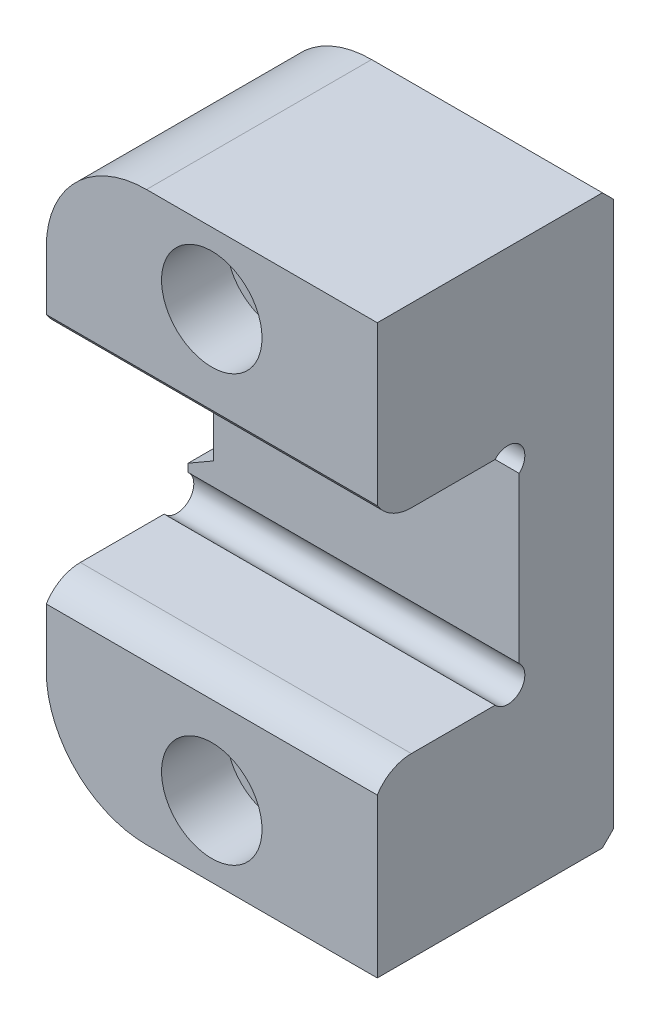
from build123d import *

# Parameters (mm, degrees)
EXTRUDE1_DEPTH              = 22.225
FILLET1_R                   = 13.462
CUT_EXTRUDE1_DEPTH          = 59.887477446
CUT_EXTRUDE2_DEPTH          = 67.599361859
SKETCH6_R                   = 2.286
CUT_EXTRUDE3_DEPTH          = 67.599361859
F_5_16_18_CBORE_D           = 8.72998
F_5_16_18_CBORE_CBORE_D     = 13.49502
F_5_16_18_CBORE_CBORE_DEPTH = 8.73125
CHAMFER3_SIZE               = 3.81
CHAMFER3_SIZE2              = 1.020886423
CHAMFER1_SIZE               = 1.524


with BuildPart() as part:
    # Sketch1 → Extrude1 (new, symmetric)
    with BuildSketch(Plane(origin=(0, 0, 0), x_dir=(0, 0, -1), z_dir=(1, 0, 0))):
        Polygon((0, 14.2875), (19.05, 14.2875), (19.05, -14.2875), (0, -14.2875), (0, -38.1), (31.75, -38.1), (31.75, 38.1), (0, 38.1), align=None)
    extrude(amount=EXTRUDE1_DEPTH, both=True)

    # Fillet1
    fillet1_edges = [part.edges().sort_by_distance(p)[0] for p in [
        (-22.225, 38.1, -15.875),
        (-22.225, -38.1, -15.875),
    ]]
    fillet(fillet1_edges, radius=FILLET1_R)

    # Sketch2 → Cut-Extrude1 (cut, through all)
    with BuildSketch(Plane(origin=(-9.525, 0, -31.75), x_dir=(1, 0, 0), z_dir=(0, 0, 1))):
        Polygon((-13.49375, 10.441543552), (-13.49375, -10.441543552), (-10.31875, -8.608456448), (-10.31875, 8.608456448), align=None)
    extrude(amount=CUT_EXTRUDE1_DEPTH, mode=Mode.SUBTRACT)

    # Sketch5 → Cut-Extrude2 (cut, through all)
    with BuildSketch(Plane(origin=(22.225, 0, 0), x_dir=(0, 0, -1), z_dir=(1, 0, 0))):
        with BuildLine():
            Line((-1.778, -13.6525), (4.572, -13.6525))
            Line((4.572, -13.6525), (4.572, -14.2875))
            ThreePointArc((4.572, -14.2875), (1.956909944, -14.9651379), (0, -16.8275))
            Line((0, -16.8275), (-1.778, -16.8275))
            Line((-1.778, -16.8275), (-1.778, -13.6525))
        make_face()
        with BuildLine():
            Line((4.572, 13.6525), (4.572, 14.2875))
            ThreePointArc((4.572, 14.2875), (1.956909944, 14.9651379), (0, 16.8275))
            Line((0, 16.8275), (-1.778, 16.8275))
            Line((-1.778, 16.8275), (-1.778, 13.6525))
            Line((-1.778, 13.6525), (4.572, 13.6525))
        make_face()
    extrude(amount=-CUT_EXTRUDE2_DEPTH, mode=Mode.SUBTRACT)

    # Sketch6 → Cut-Extrude3 (cut, through all)
    with BuildSketch(Plane(origin=(22.225, 0, 0), x_dir=(0, 0, -1), z_dir=(1, 0, 0))):
        with Locations((17.526, 12.7635)):
            Circle(SKETCH6_R)
        with Locations((17.526, -12.7635)):
            Circle(SKETCH6_R)
    extrude(amount=-CUT_EXTRUDE3_DEPTH, mode=Mode.SUBTRACT)

    # 5_16_-18 CBORE (through all)
    with Locations(Plane.XY):
        with Locations((0, 28.575), (0, -28.575)):
            CounterBoreHole(F_5_16_18_CBORE_D / 2, F_5_16_18_CBORE_CBORE_D / 2, F_5_16_18_CBORE_CBORE_DEPTH)

    # Chamfer3
    chamfer3_edges = [part.edges().sort_by_distance(p)[0] for p in [
        (-19.84375, 0, -19.05),
    ]]
    chamfer3_side = [part.faces().sort_by_distance(p)[0] for p in [
        (-19.84375, 0, -25.4),
    ]]
    chamfer(chamfer3_edges, length=CHAMFER3_SIZE, length2=CHAMFER3_SIZE2, reference=chamfer3_side[0])

    # Chamfer1
    chamfer1_edges = [part.edges().sort_by_distance(p)[0] for p in [
        (6.731, 38.1, -31.75),
        (6.731, -38.1, -31.75),
        (-22.225, -17.310635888, -31.75),
        (-18.282071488, 34.157071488, -31.75),
        (-18.282071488, -34.157071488, -31.75),
        (-22.225, 17.310635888, -31.75),
    ]]
    chamfer(chamfer1_edges, length=CHAMFER1_SIZE)


solid = part.part
